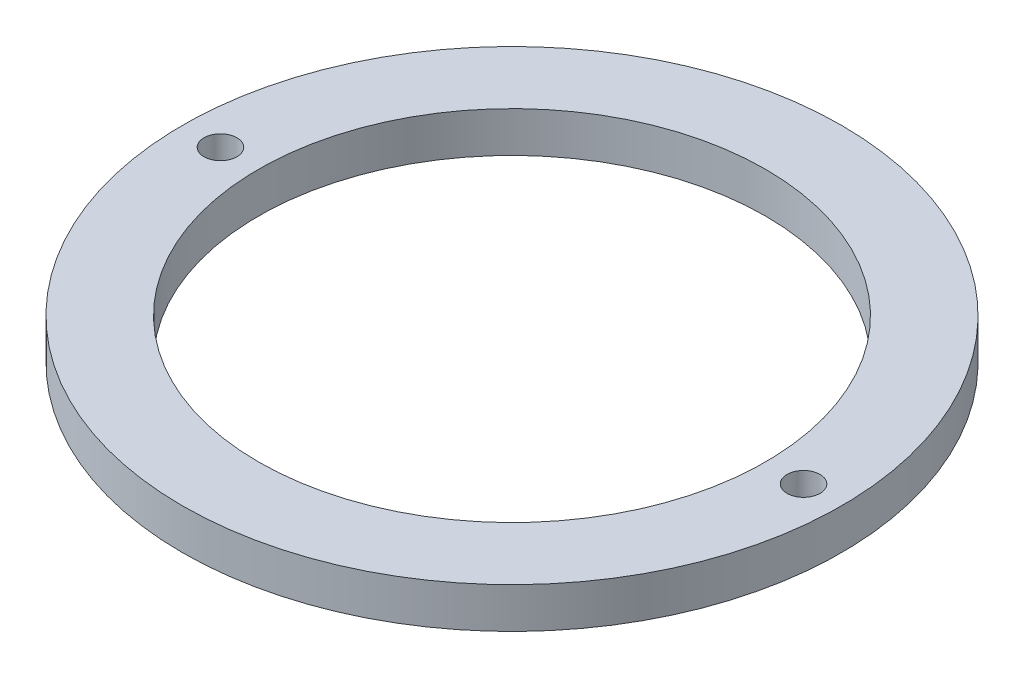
ISO-10303-21;
HEADER;
FILE_DESCRIPTION(('STEP AP214'),'2;1');
FILE_NAME('part.step','',(''),(''),'','','');
FILE_SCHEMA(('AUTOMOTIVE_DESIGN { 1 0 10303 214 1 1 1 1 }'));
ENDSEC;
DATA;
#1=APPLICATION_CONTEXT('core data for automotive mechanical design processes');
#2=APPLICATION_PROTOCOL_DEFINITION('international standard','automotive_design',2000,#1);
#3=PRODUCT_CONTEXT('',#1,'mechanical');
#4=PRODUCT('Part','Part','',(#3));
#5=PRODUCT_RELATED_PRODUCT_CATEGORY('part','',(#4));
#6=PRODUCT_DEFINITION_FORMATION('','',#4);
#7=PRODUCT_DEFINITION_CONTEXT('part definition',#1,'design');
#8=PRODUCT_DEFINITION('design','',#6,#7);
#9=PRODUCT_DEFINITION_SHAPE('','',#8);
#10=(LENGTH_UNIT() NAMED_UNIT(*) SI_UNIT(.MILLI.,.METRE.));
#11=(NAMED_UNIT(*) PLANE_ANGLE_UNIT() SI_UNIT($,.RADIAN.));
#12=(NAMED_UNIT(*) SI_UNIT($,.STERADIAN.) SOLID_ANGLE_UNIT());
#13=UNCERTAINTY_MEASURE_WITH_UNIT(LENGTH_MEASURE(1.E-05),#10,'distance_accuracy_value','');
#14=(GEOMETRIC_REPRESENTATION_CONTEXT(3) GLOBAL_UNCERTAINTY_ASSIGNED_CONTEXT((#13)) GLOBAL_UNIT_ASSIGNED_CONTEXT((#10,
#11,#12)) REPRESENTATION_CONTEXT('',''));
#15=CARTESIAN_POINT('',(0.,0.,0.));
#16=DIRECTION('',(0.,0.,1.));
#17=DIRECTION('',(1.,0.,0.));
#18=AXIS2_PLACEMENT_3D('',#15,#16,#17);
#19=CARTESIAN_POINT('',(0.,8.,0.));
#20=DIRECTION('',(0.,1.,0.));
#21=DIRECTION('',(0.,0.,1.));
#22=AXIS2_PLACEMENT_3D('',#19,#20,#21);
#23=PLANE('',#22);
#24=CARTESIAN_POINT('',(-57.5,8.,0.));
#25=DIRECTION('',(0.,1.,0.));
#26=DIRECTION('',(0.,0.,1.));
#27=AXIS2_PLACEMENT_3D('',#24,#25,#26);
#28=CIRCLE('',#27,3.25);
#29=CARTESIAN_POINT('',(-57.5,8.,3.25));
#30=VERTEX_POINT('',#29);
#31=EDGE_CURVE('E30',#30,#30,#28,.T.);
#32=ORIENTED_EDGE('',*,*,#31,.F.);
#33=EDGE_LOOP('',(#32));
#34=FACE_BOUND('',#33,.T.);
#35=CARTESIAN_POINT('',(0.,8.,0.));
#36=DIRECTION('',(0.,1.,0.));
#37=DIRECTION('',(0.,0.,1.));
#38=AXIS2_PLACEMENT_3D('',#35,#36,#37);
#39=CIRCLE('',#38,65.);
#40=CARTESIAN_POINT('',(0.,8.,65.));
#41=VERTEX_POINT('',#40);
#42=EDGE_CURVE('E9',#41,#41,#39,.T.);
#43=ORIENTED_EDGE('',*,*,#42,.T.);
#44=EDGE_LOOP('',(#43));
#45=FACE_BOUND('',#44,.T.);
#46=CARTESIAN_POINT('',(0.,8.,0.));
#47=DIRECTION('',(0.,1.,0.));
#48=DIRECTION('',(0.,0.,1.));
#49=AXIS2_PLACEMENT_3D('',#46,#47,#48);
#50=CIRCLE('',#49,50.);
#51=CARTESIAN_POINT('',(0.,8.,50.));
#52=VERTEX_POINT('',#51);
#53=EDGE_CURVE('E25',#52,#52,#50,.T.);
#54=ORIENTED_EDGE('',*,*,#53,.F.);
#55=EDGE_LOOP('',(#54));
#56=FACE_BOUND('',#55,.T.);
#57=CARTESIAN_POINT('',(57.5,8.,0.));
#58=DIRECTION('',(0.,1.,0.));
#59=DIRECTION('',(0.,0.,1.));
#60=AXIS2_PLACEMENT_3D('',#57,#58,#59);
#61=CIRCLE('',#60,3.25);
#62=CARTESIAN_POINT('',(57.5,8.,3.25));
#63=VERTEX_POINT('',#62);
#64=EDGE_CURVE('E36',#63,#63,#61,.T.);
#65=ORIENTED_EDGE('',*,*,#64,.F.);
#66=EDGE_LOOP('',(#65));
#67=FACE_BOUND('',#66,.T.);
#68=ADVANCED_FACE('F14',(#34,#45,#56,#67),#23,.T.);
#69=CARTESIAN_POINT('',(0.,0.,0.));
#70=DIRECTION('',(0.,1.,0.));
#71=DIRECTION('',(0.,0.,1.));
#72=AXIS2_PLACEMENT_3D('',#69,#70,#71);
#73=PLANE('',#72);
#74=CARTESIAN_POINT('',(0.,0.,0.));
#75=DIRECTION('',(0.,1.,0.));
#76=DIRECTION('',(0.,0.,1.));
#77=AXIS2_PLACEMENT_3D('',#74,#75,#76);
#78=CIRCLE('',#77,65.);
#79=CARTESIAN_POINT('',(0.,0.,65.));
#80=VERTEX_POINT('',#79);
#81=EDGE_CURVE('E18',#80,#80,#78,.T.);
#82=ORIENTED_EDGE('',*,*,#81,.F.);
#83=EDGE_LOOP('',(#82));
#84=FACE_BOUND('',#83,.T.);
#85=CARTESIAN_POINT('',(0.,0.,0.));
#86=DIRECTION('',(0.,1.,0.));
#87=DIRECTION('',(0.,0.,1.));
#88=AXIS2_PLACEMENT_3D('',#85,#86,#87);
#89=CIRCLE('',#88,50.);
#90=CARTESIAN_POINT('',(0.,0.,50.));
#91=VERTEX_POINT('',#90);
#92=EDGE_CURVE('E27',#91,#91,#89,.T.);
#93=ORIENTED_EDGE('',*,*,#92,.T.);
#94=EDGE_LOOP('',(#93));
#95=FACE_BOUND('',#94,.T.);
#96=CARTESIAN_POINT('',(-57.5,0.,0.));
#97=DIRECTION('',(0.,1.,0.));
#98=DIRECTION('',(0.,0.,1.));
#99=AXIS2_PLACEMENT_3D('',#96,#97,#98);
#100=CIRCLE('',#99,3.25);
#101=CARTESIAN_POINT('',(-57.5,0.,3.25));
#102=VERTEX_POINT('',#101);
#103=EDGE_CURVE('E33',#102,#102,#100,.T.);
#104=ORIENTED_EDGE('',*,*,#103,.T.);
#105=EDGE_LOOP('',(#104));
#106=FACE_BOUND('',#105,.T.);
#107=CARTESIAN_POINT('',(57.5,0.,0.));
#108=DIRECTION('',(0.,1.,0.));
#109=DIRECTION('',(0.,0.,1.));
#110=AXIS2_PLACEMENT_3D('',#107,#108,#109);
#111=CIRCLE('',#110,3.25);
#112=CARTESIAN_POINT('',(57.5,0.,3.25));
#113=VERTEX_POINT('',#112);
#114=EDGE_CURVE('E39',#113,#113,#111,.T.);
#115=ORIENTED_EDGE('',*,*,#114,.T.);
#116=EDGE_LOOP('',(#115));
#117=FACE_BOUND('',#116,.T.);
#118=ADVANCED_FACE('F49',(#84,#95,#106,#117),#73,.F.);
#119=CARTESIAN_POINT('',(0.,8.,0.));
#120=DIRECTION('',(0.,-1.,0.));
#121=DIRECTION('',(0.,0.,-1.));
#122=AXIS2_PLACEMENT_3D('',#119,#120,#121);
#123=CYLINDRICAL_SURFACE('',#122,65.);
#124=ORIENTED_EDGE('',*,*,#42,.F.);
#125=EDGE_LOOP('',(#124));
#126=FACE_BOUND('',#125,.T.);
#127=ORIENTED_EDGE('',*,*,#81,.T.);
#128=EDGE_LOOP('',(#127));
#129=FACE_BOUND('',#128,.T.);
#130=ADVANCED_FACE('F16',(#126,#129),#123,.T.);
#131=CARTESIAN_POINT('',(0.,8.,0.));
#132=DIRECTION('',(0.,-1.,0.));
#133=DIRECTION('',(0.,0.,-1.));
#134=AXIS2_PLACEMENT_3D('',#131,#132,#133);
#135=CYLINDRICAL_SURFACE('',#134,50.);
#136=ORIENTED_EDGE('',*,*,#53,.T.);
#137=EDGE_LOOP('',(#136));
#138=FACE_BOUND('',#137,.T.);
#139=ORIENTED_EDGE('',*,*,#92,.F.);
#140=EDGE_LOOP('',(#139));
#141=FACE_BOUND('',#140,.T.);
#142=ADVANCED_FACE('F60',(#138,#141),#135,.F.);
#143=CARTESIAN_POINT('',(-57.5,8.,0.));
#144=DIRECTION('',(0.,-1.,0.));
#145=DIRECTION('',(0.,0.,-1.));
#146=AXIS2_PLACEMENT_3D('',#143,#144,#145);
#147=CYLINDRICAL_SURFACE('',#146,3.25);
#148=ORIENTED_EDGE('',*,*,#31,.T.);
#149=EDGE_LOOP('',(#148));
#150=FACE_BOUND('',#149,.T.);
#151=ORIENTED_EDGE('',*,*,#103,.F.);
#152=EDGE_LOOP('',(#151));
#153=FACE_BOUND('',#152,.T.);
#154=ADVANCED_FACE('F63',(#150,#153),#147,.F.);
#155=CARTESIAN_POINT('',(57.5,8.,0.));
#156=DIRECTION('',(0.,-1.,0.));
#157=DIRECTION('',(0.,0.,-1.));
#158=AXIS2_PLACEMENT_3D('',#155,#156,#157);
#159=CYLINDRICAL_SURFACE('',#158,3.25);
#160=ORIENTED_EDGE('',*,*,#64,.T.);
#161=EDGE_LOOP('',(#160));
#162=FACE_BOUND('',#161,.T.);
#163=ORIENTED_EDGE('',*,*,#114,.F.);
#164=EDGE_LOOP('',(#163));
#165=FACE_BOUND('',#164,.T.);
#166=ADVANCED_FACE('F45',(#162,#165),#159,.F.);
#167=CLOSED_SHELL('',(#68,#118,#130,#142,#154,#166));
#168=MANIFOLD_SOLID_BREP('B1',#167);
#169=ADVANCED_BREP_SHAPE_REPRESENTATION('',(#18,#168),#14);
#170=SHAPE_DEFINITION_REPRESENTATION(#9,#169);
ENDSEC;
END-ISO-10303-21;
